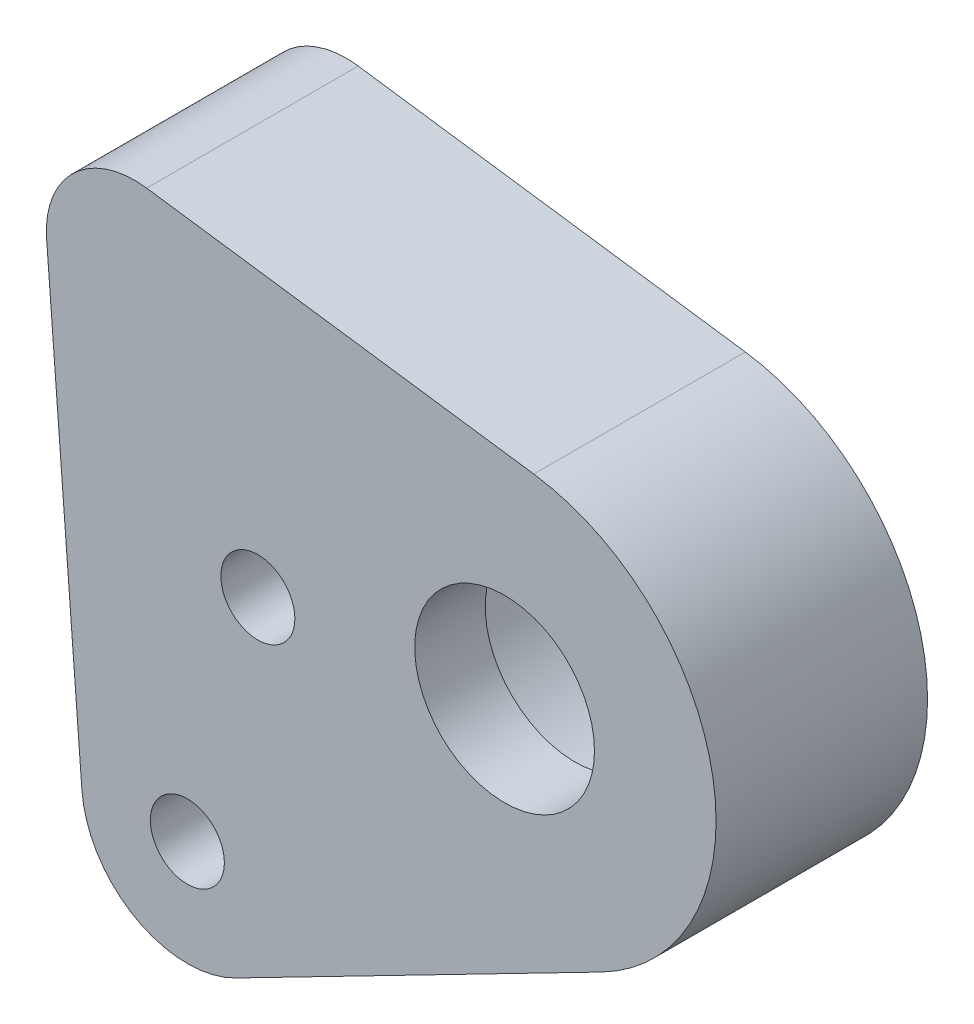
ISO-10303-21;
HEADER;
FILE_DESCRIPTION(('STEP AP214'),'2;1');
FILE_NAME('part.step','',(''),(''),'','','');
FILE_SCHEMA(('AUTOMOTIVE_DESIGN { 1 0 10303 214 1 1 1 1 }'));
ENDSEC;
DATA;
#1=APPLICATION_CONTEXT('core data for automotive mechanical design processes');
#2=APPLICATION_PROTOCOL_DEFINITION('international standard','automotive_design',2000,#1);
#3=PRODUCT_CONTEXT('',#1,'mechanical');
#4=PRODUCT('Part','Part','',(#3));
#5=PRODUCT_RELATED_PRODUCT_CATEGORY('part','',(#4));
#6=PRODUCT_DEFINITION_FORMATION('','',#4);
#7=PRODUCT_DEFINITION_CONTEXT('part definition',#1,'design');
#8=PRODUCT_DEFINITION('design','',#6,#7);
#9=PRODUCT_DEFINITION_SHAPE('','',#8);
#10=(LENGTH_UNIT() NAMED_UNIT(*) SI_UNIT(.MILLI.,.METRE.));
#11=(NAMED_UNIT(*) PLANE_ANGLE_UNIT() SI_UNIT($,.RADIAN.));
#12=(NAMED_UNIT(*) SI_UNIT($,.STERADIAN.) SOLID_ANGLE_UNIT());
#13=UNCERTAINTY_MEASURE_WITH_UNIT(LENGTH_MEASURE(1.E-05),#10,'distance_accuracy_value','');
#14=(GEOMETRIC_REPRESENTATION_CONTEXT(3) GLOBAL_UNCERTAINTY_ASSIGNED_CONTEXT((#13)) GLOBAL_UNIT_ASSIGNED_CONTEXT((#10,
#11,#12)) REPRESENTATION_CONTEXT('',''));
#15=CARTESIAN_POINT('',(0.,0.,0.));
#16=DIRECTION('',(0.,0.,1.));
#17=DIRECTION('',(1.,0.,0.));
#18=AXIS2_PLACEMENT_3D('',#15,#16,#17);
#19=CARTESIAN_POINT('',(-27.,-16.,54.4));
#20=DIRECTION('',(0.,0.,1.));
#21=DIRECTION('',(1.,0.,0.));
#22=AXIS2_PLACEMENT_3D('',#19,#20,#21);
#23=PLANE('',#22);
#24=CARTESIAN_POINT('',(-27.,-16.,54.4));
#25=DIRECTION('',(0.,0.,1.));
#26=DIRECTION('',(1.,0.,0.));
#27=AXIS2_PLACEMENT_3D('',#24,#25,#26);
#28=CIRCLE('',#27,5.);
#29=CARTESIAN_POINT('',(-26.308588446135,-11.0480357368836,54.4));
#30=VERTEX_POINT('',#29);
#31=CARTESIAN_POINT('',(-31.9853155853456,-16.3829210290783,54.4));
#32=VERTEX_POINT('',#31);
#33=EDGE_CURVE('E94',#30,#32,#28,.T.);
#34=ORIENTED_EDGE('',*,*,#33,.F.);
#35=DIRECTION('',(-0.990392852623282,0.138282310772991,0.));
#36=VECTOR('',#35,1.);
#37=CARTESIAN_POINT('',(-4.3406122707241,-14.1152857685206,54.4));
#38=LINE('',#37,#36);
#39=CARTESIAN_POINT('',(-4.3406122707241,-14.1152857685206,54.4));
#40=VERTEX_POINT('',#39);
#41=EDGE_CURVE('E51',#40,#30,#38,.T.);
#42=ORIENTED_EDGE('',*,*,#41,.F.);
#43=CARTESIAN_POINT('',(-6.,-26.,54.4));
#44=DIRECTION('',(0.,0.,1.));
#45=DIRECTION('',(1.,0.,0.));
#46=AXIS2_PLACEMENT_3D('',#43,#44,#45);
#47=CIRCLE('',#46,12.);
#48=CARTESIAN_POINT('',(-0.513498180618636,-36.672314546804,54.4));
#49=VERTEX_POINT('',#48);
#50=EDGE_CURVE('E59',#49,#40,#47,.T.);
#51=ORIENTED_EDGE('',*,*,#50,.F.);
#52=DIRECTION('',(0.889359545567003,0.457208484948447,0.));
#53=VECTOR('',#52,1.);
#54=CARTESIAN_POINT('',(-21.2567490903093,-47.336157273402,54.4));
#55=LINE('',#54,#53);
#56=CARTESIAN_POINT('',(-21.2567490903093,-47.336157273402,54.4));
#57=VERTEX_POINT('',#56);
#58=EDGE_CURVE('E142',#57,#49,#55,.T.);
#59=ORIENTED_EDGE('',*,*,#58,.F.);
#60=CARTESIAN_POINT('',(-24.,-42.,54.4));
#61=DIRECTION('',(0.,0.,1.));
#62=DIRECTION('',(1.,0.,0.));
#63=AXIS2_PLACEMENT_3D('',#60,#61,#62);
#64=CIRCLE('',#63,6.00000000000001);
#65=CARTESIAN_POINT('',(-29.9823787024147,-42.459505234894,54.4));
#66=VERTEX_POINT('',#65);
#67=EDGE_CURVE('E140',#66,#57,#64,.T.);
#68=ORIENTED_EDGE('',*,*,#67,.F.);
#69=DIRECTION('',(0.0765842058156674,-0.997063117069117,0.));
#70=VECTOR('',#69,1.);
#71=CARTESIAN_POINT('',(-31.9853155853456,-16.3829210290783,54.4));
#72=LINE('',#71,#70);
#73=EDGE_CURVE('E138',#32,#66,#72,.T.);
#74=ORIENTED_EDGE('',*,*,#73,.F.);
#75=EDGE_LOOP('',(#34,#42,#51,#59,#68,#74));
#76=FACE_BOUND('',#75,.T.);
#77=CARTESIAN_POINT('',(-6.,-26.,54.4));
#78=DIRECTION('',(0.,0.,1.));
#79=DIRECTION('',(1.,0.,0.));
#80=AXIS2_PLACEMENT_3D('',#77,#78,#79);
#81=CIRCLE('',#80,9.);
#82=CARTESIAN_POINT('',(3.,-26.,54.4));
#83=VERTEX_POINT('',#82);
#84=EDGE_CURVE('E132',#83,#83,#81,.T.);
#85=ORIENTED_EDGE('',*,*,#84,.T.);
#86=EDGE_LOOP('',(#85));
#87=FACE_BOUND('',#86,.T.);
#88=CARTESIAN_POINT('',(-20.,-28.,54.4));
#89=DIRECTION('',(0.,0.,1.));
#90=DIRECTION('',(1.,0.,0.));
#91=AXIS2_PLACEMENT_3D('',#88,#89,#90);
#92=CIRCLE('',#91,2.1);
#93=CARTESIAN_POINT('',(-17.9,-28.,54.4));
#94=VERTEX_POINT('',#93);
#95=EDGE_CURVE('E129',#94,#94,#92,.T.);
#96=ORIENTED_EDGE('',*,*,#95,.T.);
#97=EDGE_LOOP('',(#96));
#98=FACE_BOUND('',#97,.T.);
#99=CARTESIAN_POINT('',(-24.,-42.,54.4));
#100=DIRECTION('',(0.,0.,1.));
#101=DIRECTION('',(1.,0.,0.));
#102=AXIS2_PLACEMENT_3D('',#99,#100,#101);
#103=CIRCLE('',#102,2.09999999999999);
#104=CARTESIAN_POINT('',(-21.9,-42.,54.4));
#105=VERTEX_POINT('',#104);
#106=EDGE_CURVE('E126',#105,#105,#103,.T.);
#107=ORIENTED_EDGE('',*,*,#106,.T.);
#108=EDGE_LOOP('',(#107));
#109=FACE_BOUND('',#108,.T.);
#110=ADVANCED_FACE('F36',(#76,#87,#98,#109),#23,.F.);
#111=CARTESIAN_POINT('',(-27.,-16.,62.4));
#112=DIRECTION('',(0.,0.,-1.));
#113=DIRECTION('',(-1.,0.,0.));
#114=AXIS2_PLACEMENT_3D('',#111,#112,#113);
#115=CYLINDRICAL_SURFACE('',#114,5.);
#116=ORIENTED_EDGE('',*,*,#33,.T.);
#117=DIRECTION('',(0.,0.,-1.));
#118=VECTOR('',#117,1.);
#119=CARTESIAN_POINT('',(-31.9853155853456,-16.3829210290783,62.4));
#120=LINE('',#119,#118);
#121=CARTESIAN_POINT('',(-31.9853155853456,-16.3829210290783,66.4));
#122=VERTEX_POINT('',#121);
#123=EDGE_CURVE('E11',#122,#32,#120,.T.);
#124=ORIENTED_EDGE('',*,*,#123,.F.);
#125=CARTESIAN_POINT('',(-27.,-16.,66.4));
#126=DIRECTION('',(0.,0.,1.));
#127=DIRECTION('',(1.,0.,0.));
#128=AXIS2_PLACEMENT_3D('',#125,#126,#127);
#129=CIRCLE('',#128,5.);
#130=CARTESIAN_POINT('',(-26.308588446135,-11.0480357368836,66.4));
#131=VERTEX_POINT('',#130);
#132=EDGE_CURVE('E92',#131,#122,#129,.T.);
#133=ORIENTED_EDGE('',*,*,#132,.F.);
#134=DIRECTION('',(0.,0.,-1.));
#135=VECTOR('',#134,1.);
#136=CARTESIAN_POINT('',(-26.308588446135,-11.0480357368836,62.4));
#137=LINE('',#136,#135);
#138=EDGE_CURVE('E146',#131,#30,#137,.T.);
#139=ORIENTED_EDGE('',*,*,#138,.T.);
#140=EDGE_LOOP('',(#116,#124,#133,#139));
#141=FACE_BOUND('',#140,.T.);
#142=ADVANCED_FACE('F38',(#141),#115,.T.);
#143=CARTESIAN_POINT('',(-31.9853155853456,-16.3829210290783,62.4));
#144=DIRECTION('',(0.997063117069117,0.0765842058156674,0.));
#145=DIRECTION('',(-0.0765842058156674,0.997063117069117,0.));
#146=AXIS2_PLACEMENT_3D('',#143,#144,#145);
#147=PLANE('',#146);
#148=ORIENTED_EDGE('',*,*,#73,.T.);
#149=DIRECTION('',(0.,0.,-1.));
#150=VECTOR('',#149,1.);
#151=CARTESIAN_POINT('',(-29.9823787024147,-42.459505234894,62.4));
#152=LINE('',#151,#150);
#153=CARTESIAN_POINT('',(-29.9823787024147,-42.459505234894,66.4));
#154=VERTEX_POINT('',#153);
#155=EDGE_CURVE('E44',#154,#66,#152,.T.);
#156=ORIENTED_EDGE('',*,*,#155,.F.);
#157=DIRECTION('',(0.0765842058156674,-0.997063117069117,0.));
#158=VECTOR('',#157,1.);
#159=CARTESIAN_POINT('',(-31.9853155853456,-16.3829210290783,66.4));
#160=LINE('',#159,#158);
#161=EDGE_CURVE('E97',#122,#154,#160,.T.);
#162=ORIENTED_EDGE('',*,*,#161,.F.);
#163=ORIENTED_EDGE('',*,*,#123,.T.);
#164=EDGE_LOOP('',(#148,#156,#162,#163));
#165=FACE_BOUND('',#164,.T.);
#166=ADVANCED_FACE('F98',(#165),#147,.F.);
#167=CARTESIAN_POINT('',(-24.,-42.,62.4));
#168=DIRECTION('',(0.,0.,-1.));
#169=DIRECTION('',(-1.,0.,0.));
#170=AXIS2_PLACEMENT_3D('',#167,#168,#169);
#171=CYLINDRICAL_SURFACE('',#170,6.00000000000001);
#172=ORIENTED_EDGE('',*,*,#67,.T.);
#173=DIRECTION('',(0.,0.,-1.));
#174=VECTOR('',#173,1.);
#175=CARTESIAN_POINT('',(-21.2567490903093,-47.336157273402,62.4));
#176=LINE('',#175,#174);
#177=CARTESIAN_POINT('',(-21.2567490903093,-47.336157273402,66.4));
#178=VERTEX_POINT('',#177);
#179=EDGE_CURVE('E152',#178,#57,#176,.T.);
#180=ORIENTED_EDGE('',*,*,#179,.F.);
#181=CARTESIAN_POINT('',(-24.,-42.,66.4));
#182=DIRECTION('',(0.,0.,1.));
#183=DIRECTION('',(1.,0.,0.));
#184=AXIS2_PLACEMENT_3D('',#181,#182,#183);
#185=CIRCLE('',#184,6.00000000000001);
#186=EDGE_CURVE('E103',#154,#178,#185,.T.);
#187=ORIENTED_EDGE('',*,*,#186,.F.);
#188=ORIENTED_EDGE('',*,*,#155,.T.);
#189=EDGE_LOOP('',(#172,#180,#187,#188));
#190=FACE_BOUND('',#189,.T.);
#191=ADVANCED_FACE('F156',(#190),#171,.T.);
#192=CARTESIAN_POINT('',(-21.2567490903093,-47.336157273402,62.4));
#193=DIRECTION('',(-0.457208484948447,0.889359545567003,0.));
#194=DIRECTION('',(-0.889359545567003,-0.457208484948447,0.));
#195=AXIS2_PLACEMENT_3D('',#192,#193,#194);
#196=PLANE('',#195);
#197=ORIENTED_EDGE('',*,*,#58,.T.);
#198=DIRECTION('',(0.,0.,-1.));
#199=VECTOR('',#198,1.);
#200=CARTESIAN_POINT('',(-0.513498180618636,-36.672314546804,62.4));
#201=LINE('',#200,#199);
#202=CARTESIAN_POINT('',(-0.513498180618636,-36.672314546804,66.4));
#203=VERTEX_POINT('',#202);
#204=EDGE_CURVE('E150',#203,#49,#201,.T.);
#205=ORIENTED_EDGE('',*,*,#204,.F.);
#206=DIRECTION('',(0.889359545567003,0.457208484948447,0.));
#207=VECTOR('',#206,1.);
#208=CARTESIAN_POINT('',(-21.2567490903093,-47.336157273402,66.4));
#209=LINE('',#208,#207);
#210=EDGE_CURVE('E119',#178,#203,#209,.T.);
#211=ORIENTED_EDGE('',*,*,#210,.F.);
#212=ORIENTED_EDGE('',*,*,#179,.T.);
#213=EDGE_LOOP('',(#197,#205,#211,#212));
#214=FACE_BOUND('',#213,.T.);
#215=ADVANCED_FACE('F161',(#214),#196,.F.);
#216=CARTESIAN_POINT('',(-6.,-26.,62.4));
#217=DIRECTION('',(0.,0.,-1.));
#218=DIRECTION('',(-1.,0.,0.));
#219=AXIS2_PLACEMENT_3D('',#216,#217,#218);
#220=CYLINDRICAL_SURFACE('',#219,12.);
#221=ORIENTED_EDGE('',*,*,#50,.T.);
#222=DIRECTION('',(0.,0.,-1.));
#223=VECTOR('',#222,1.);
#224=CARTESIAN_POINT('',(-4.3406122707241,-14.1152857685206,62.4));
#225=LINE('',#224,#223);
#226=CARTESIAN_POINT('',(-4.3406122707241,-14.1152857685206,66.4));
#227=VERTEX_POINT('',#226);
#228=EDGE_CURVE('E148',#227,#40,#225,.T.);
#229=ORIENTED_EDGE('',*,*,#228,.F.);
#230=CARTESIAN_POINT('',(-6.,-26.,66.4));
#231=DIRECTION('',(0.,0.,1.));
#232=DIRECTION('',(1.,0.,0.));
#233=AXIS2_PLACEMENT_3D('',#230,#231,#232);
#234=CIRCLE('',#233,12.);
#235=EDGE_CURVE('E122',#203,#227,#234,.T.);
#236=ORIENTED_EDGE('',*,*,#235,.F.);
#237=ORIENTED_EDGE('',*,*,#204,.T.);
#238=EDGE_LOOP('',(#221,#229,#236,#237));
#239=FACE_BOUND('',#238,.T.);
#240=ADVANCED_FACE('F164',(#239),#220,.T.);
#241=CARTESIAN_POINT('',(-4.3406122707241,-14.1152857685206,62.4));
#242=DIRECTION('',(-0.138282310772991,-0.990392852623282,0.));
#243=DIRECTION('',(0.990392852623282,-0.138282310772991,0.));
#244=AXIS2_PLACEMENT_3D('',#241,#242,#243);
#245=PLANE('',#244);
#246=ORIENTED_EDGE('',*,*,#41,.T.);
#247=ORIENTED_EDGE('',*,*,#138,.F.);
#248=DIRECTION('',(-0.990392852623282,0.138282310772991,0.));
#249=VECTOR('',#248,1.);
#250=CARTESIAN_POINT('',(-4.3406122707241,-14.1152857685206,66.4));
#251=LINE('',#250,#249);
#252=EDGE_CURVE('E110',#227,#131,#251,.T.);
#253=ORIENTED_EDGE('',*,*,#252,.F.);
#254=ORIENTED_EDGE('',*,*,#228,.T.);
#255=EDGE_LOOP('',(#246,#247,#253,#254));
#256=FACE_BOUND('',#255,.T.);
#257=ADVANCED_FACE('F165',(#256),#245,.F.);
#258=CARTESIAN_POINT('',(-6.,-26.,62.4));
#259=DIRECTION('',(0.,0.,-1.));
#260=DIRECTION('',(-1.,0.,0.));
#261=AXIS2_PLACEMENT_3D('',#258,#259,#260);
#262=CYLINDRICAL_SURFACE('',#261,9.);
#263=CARTESIAN_POINT('',(-6.,-26.,62.4));
#264=DIRECTION('',(0.,0.,1.));
#265=DIRECTION('',(1.,0.,0.));
#266=AXIS2_PLACEMENT_3D('',#263,#264,#265);
#267=CIRCLE('',#266,9.);
#268=CARTESIAN_POINT('',(3.,-26.,62.4));
#269=VERTEX_POINT('',#268);
#270=EDGE_CURVE('E125',#269,#269,#267,.T.);
#271=ORIENTED_EDGE('',*,*,#270,.T.);
#272=EDGE_LOOP('',(#271));
#273=FACE_BOUND('',#272,.T.);
#274=ORIENTED_EDGE('',*,*,#84,.F.);
#275=EDGE_LOOP('',(#274));
#276=FACE_BOUND('',#275,.T.);
#277=ADVANCED_FACE('F167',(#273,#276),#262,.F.);
#278=CARTESIAN_POINT('',(-20.,-28.,62.4));
#279=DIRECTION('',(0.,0.,-1.));
#280=DIRECTION('',(-1.,0.,0.));
#281=AXIS2_PLACEMENT_3D('',#278,#279,#280);
#282=CYLINDRICAL_SURFACE('',#281,2.1);
#283=ORIENTED_EDGE('',*,*,#95,.F.);
#284=EDGE_LOOP('',(#283));
#285=FACE_BOUND('',#284,.T.);
#286=CARTESIAN_POINT('',(-20.,-28.,66.4));
#287=DIRECTION('',(0.,0.,1.));
#288=DIRECTION('',(1.,0.,0.));
#289=AXIS2_PLACEMENT_3D('',#286,#287,#288);
#290=CIRCLE('',#289,2.1);
#291=CARTESIAN_POINT('',(-17.9,-28.,66.4));
#292=VERTEX_POINT('',#291);
#293=EDGE_CURVE('E206',#292,#292,#290,.T.);
#294=ORIENTED_EDGE('',*,*,#293,.T.);
#295=EDGE_LOOP('',(#294));
#296=FACE_BOUND('',#295,.T.);
#297=ADVANCED_FACE('F173',(#285,#296),#282,.F.);
#298=CARTESIAN_POINT('',(-24.,-42.,62.4));
#299=DIRECTION('',(0.,0.,-1.));
#300=DIRECTION('',(-1.,0.,0.));
#301=AXIS2_PLACEMENT_3D('',#298,#299,#300);
#302=CYLINDRICAL_SURFACE('',#301,2.09999999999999);
#303=ORIENTED_EDGE('',*,*,#106,.F.);
#304=EDGE_LOOP('',(#303));
#305=FACE_BOUND('',#304,.T.);
#306=CARTESIAN_POINT('',(-24.,-42.,66.4));
#307=DIRECTION('',(0.,0.,1.));
#308=DIRECTION('',(1.,0.,0.));
#309=AXIS2_PLACEMENT_3D('',#306,#307,#308);
#310=CIRCLE('',#309,2.09999999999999);
#311=CARTESIAN_POINT('',(-21.9,-42.,66.4));
#312=VERTEX_POINT('',#311);
#313=EDGE_CURVE('E208',#312,#312,#310,.T.);
#314=ORIENTED_EDGE('',*,*,#313,.T.);
#315=EDGE_LOOP('',(#314));
#316=FACE_BOUND('',#315,.T.);
#317=ADVANCED_FACE('F185',(#305,#316),#302,.F.);
#318=CARTESIAN_POINT('',(-27.,-16.,62.4));
#319=DIRECTION('',(0.,0.,1.));
#320=DIRECTION('',(1.,0.,0.));
#321=AXIS2_PLACEMENT_3D('',#318,#319,#320);
#322=PLANE('',#321);
#323=CARTESIAN_POINT('',(-6.,-26.,62.4));
#324=DIRECTION('',(0.,0.,1.));
#325=DIRECTION('',(1.,0.,0.));
#326=AXIS2_PLACEMENT_3D('',#323,#324,#325);
#327=CIRCLE('',#326,5.1);
#328=CARTESIAN_POINT('',(-0.900000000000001,-26.,62.4));
#329=VERTEX_POINT('',#328);
#330=EDGE_CURVE('E114',#329,#329,#327,.T.);
#331=ORIENTED_EDGE('',*,*,#330,.T.);
#332=EDGE_LOOP('',(#331));
#333=FACE_BOUND('',#332,.T.);
#334=ORIENTED_EDGE('',*,*,#270,.F.);
#335=EDGE_LOOP('',(#334));
#336=FACE_BOUND('',#335,.T.);
#337=ADVANCED_FACE('F189',(#333,#336),#322,.F.);
#338=CARTESIAN_POINT('',(-27.,-16.,66.4));
#339=DIRECTION('',(0.,0.,1.));
#340=DIRECTION('',(1.,0.,0.));
#341=AXIS2_PLACEMENT_3D('',#338,#339,#340);
#342=PLANE('',#341);
#343=ORIENTED_EDGE('',*,*,#293,.F.);
#344=EDGE_LOOP('',(#343));
#345=FACE_BOUND('',#344,.T.);
#346=ORIENTED_EDGE('',*,*,#132,.T.);
#347=ORIENTED_EDGE('',*,*,#161,.T.);
#348=ORIENTED_EDGE('',*,*,#186,.T.);
#349=ORIENTED_EDGE('',*,*,#210,.T.);
#350=ORIENTED_EDGE('',*,*,#235,.T.);
#351=ORIENTED_EDGE('',*,*,#252,.T.);
#352=EDGE_LOOP('',(#346,#347,#348,#349,#350,#351));
#353=FACE_BOUND('',#352,.T.);
#354=CARTESIAN_POINT('',(-6.,-26.,66.4));
#355=DIRECTION('',(0.,0.,1.));
#356=DIRECTION('',(1.,0.,0.));
#357=AXIS2_PLACEMENT_3D('',#354,#355,#356);
#358=CIRCLE('',#357,5.1);
#359=CARTESIAN_POINT('',(-0.900000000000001,-26.,66.4));
#360=VERTEX_POINT('',#359);
#361=EDGE_CURVE('E111',#360,#360,#358,.T.);
#362=ORIENTED_EDGE('',*,*,#361,.F.);
#363=EDGE_LOOP('',(#362));
#364=FACE_BOUND('',#363,.T.);
#365=ORIENTED_EDGE('',*,*,#313,.F.);
#366=EDGE_LOOP('',(#365));
#367=FACE_BOUND('',#366,.T.);
#368=ADVANCED_FACE('F106',(#345,#353,#364,#367),#342,.T.);
#369=CARTESIAN_POINT('',(-6.,-26.,66.4));
#370=DIRECTION('',(0.,0.,-1.));
#371=DIRECTION('',(-1.,0.,0.));
#372=AXIS2_PLACEMENT_3D('',#369,#370,#371);
#373=CYLINDRICAL_SURFACE('',#372,5.1);
#374=ORIENTED_EDGE('',*,*,#361,.T.);
#375=EDGE_LOOP('',(#374));
#376=FACE_BOUND('',#375,.T.);
#377=ORIENTED_EDGE('',*,*,#330,.F.);
#378=EDGE_LOOP('',(#377));
#379=FACE_BOUND('',#378,.T.);
#380=ADVANCED_FACE('F196',(#376,#379),#373,.F.);
#381=CLOSED_SHELL('',(#110,#142,#166,#191,#215,#240,#257,#277,#297,#317,#337,#368,#380));
#382=MANIFOLD_SOLID_BREP('B2',#381);
#383=ADVANCED_BREP_SHAPE_REPRESENTATION('',(#18,#382),#14);
#384=SHAPE_DEFINITION_REPRESENTATION(#9,#383);
ENDSEC;
END-ISO-10303-21;
